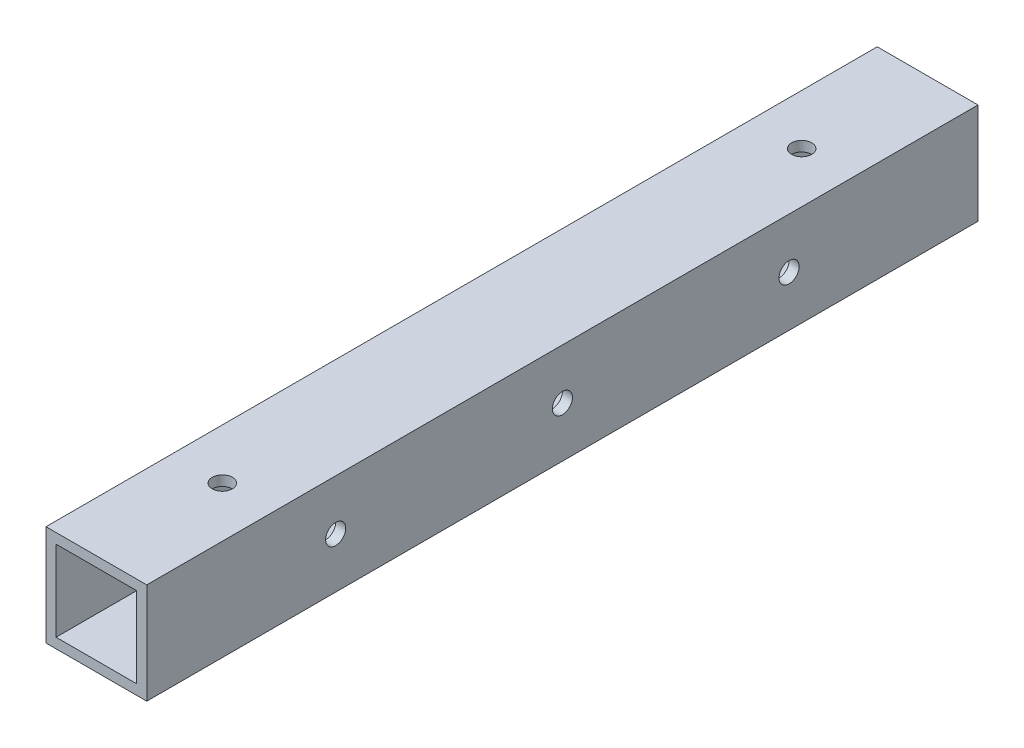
ISO-10303-21;
HEADER;
FILE_DESCRIPTION(('STEP AP214'),'2;1');
FILE_NAME('part.step','',(''),(''),'','','');
FILE_SCHEMA(('AUTOMOTIVE_DESIGN { 1 0 10303 214 1 1 1 1 }'));
ENDSEC;
DATA;
#1=APPLICATION_CONTEXT('core data for automotive mechanical design processes');
#2=APPLICATION_PROTOCOL_DEFINITION('international standard','automotive_design',2000,#1);
#3=PRODUCT_CONTEXT('',#1,'mechanical');
#4=PRODUCT('Part','Part','',(#3));
#5=PRODUCT_RELATED_PRODUCT_CATEGORY('part','',(#4));
#6=PRODUCT_DEFINITION_FORMATION('','',#4);
#7=PRODUCT_DEFINITION_CONTEXT('part definition',#1,'design');
#8=PRODUCT_DEFINITION('design','',#6,#7);
#9=PRODUCT_DEFINITION_SHAPE('','',#8);
#10=(LENGTH_UNIT() NAMED_UNIT(*) SI_UNIT(.MILLI.,.METRE.));
#11=(NAMED_UNIT(*) PLANE_ANGLE_UNIT() SI_UNIT($,.RADIAN.));
#12=(NAMED_UNIT(*) SI_UNIT($,.STERADIAN.) SOLID_ANGLE_UNIT());
#13=UNCERTAINTY_MEASURE_WITH_UNIT(LENGTH_MEASURE(1.E-05),#10,'distance_accuracy_value','');
#14=(GEOMETRIC_REPRESENTATION_CONTEXT(3) GLOBAL_UNCERTAINTY_ASSIGNED_CONTEXT((#13)) GLOBAL_UNIT_ASSIGNED_CONTEXT((#10,
#11,#12)) REPRESENTATION_CONTEXT('',''));
#15=CARTESIAN_POINT('',(0.,0.,0.));
#16=DIRECTION('',(0.,0.,1.));
#17=DIRECTION('',(1.,0.,0.));
#18=AXIS2_PLACEMENT_3D('',#15,#16,#17);
#19=CARTESIAN_POINT('',(0.,0.,165.));
#20=DIRECTION('',(0.,0.,1.));
#21=DIRECTION('',(1.,0.,0.));
#22=AXIS2_PLACEMENT_3D('',#19,#20,#21);
#23=PLANE('',#22);
#24=DIRECTION('',(0.,1.,0.));
#25=VECTOR('',#24,1.);
#26=CARTESIAN_POINT('',(10.,10.,165.));
#27=LINE('',#26,#25);
#28=CARTESIAN_POINT('',(10.,-10.,165.));
#29=VERTEX_POINT('',#28);
#30=CARTESIAN_POINT('',(10.,10.,165.));
#31=VERTEX_POINT('',#30);
#32=EDGE_CURVE('E140',#29,#31,#27,.T.);
#33=ORIENTED_EDGE('',*,*,#32,.T.);
#34=DIRECTION('',(-1.,0.,0.));
#35=VECTOR('',#34,1.);
#36=CARTESIAN_POINT('',(-10.,10.,165.));
#37=LINE('',#36,#35);
#38=CARTESIAN_POINT('',(-10.,10.,165.));
#39=VERTEX_POINT('',#38);
#40=EDGE_CURVE('E143',#31,#39,#37,.T.);
#41=ORIENTED_EDGE('',*,*,#40,.T.);
#42=DIRECTION('',(0.,-1.,0.));
#43=VECTOR('',#42,1.);
#44=CARTESIAN_POINT('',(-10.,10.,165.));
#45=LINE('',#44,#43);
#46=CARTESIAN_POINT('',(-9.99999999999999,-10.,165.));
#47=VERTEX_POINT('',#46);
#48=EDGE_CURVE('E146',#39,#47,#45,.T.);
#49=ORIENTED_EDGE('',*,*,#48,.T.);
#50=DIRECTION('',(1.,0.,0.));
#51=VECTOR('',#50,1.);
#52=CARTESIAN_POINT('',(-9.99999999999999,-10.,165.));
#53=LINE('',#52,#51);
#54=EDGE_CURVE('E148',#47,#29,#53,.T.);
#55=ORIENTED_EDGE('',*,*,#54,.T.);
#56=EDGE_LOOP('',(#33,#41,#49,#55));
#57=FACE_BOUND('',#56,.T.);
#58=DIRECTION('',(1.,0.,0.));
#59=VECTOR('',#58,1.);
#60=CARTESIAN_POINT('',(-8.,-8.,165.));
#61=LINE('',#60,#59);
#62=CARTESIAN_POINT('',(-8.,-8.,165.));
#63=VERTEX_POINT('',#62);
#64=CARTESIAN_POINT('',(8.,-8.,165.));
#65=VERTEX_POINT('',#64);
#66=EDGE_CURVE('E110',#63,#65,#61,.T.);
#67=ORIENTED_EDGE('',*,*,#66,.F.);
#68=DIRECTION('',(0.,-1.,0.));
#69=VECTOR('',#68,1.);
#70=CARTESIAN_POINT('',(-8.,8.,165.));
#71=LINE('',#70,#69);
#72=CARTESIAN_POINT('',(-8.,8.,165.));
#73=VERTEX_POINT('',#72);
#74=EDGE_CURVE('E102',#73,#63,#71,.T.);
#75=ORIENTED_EDGE('',*,*,#74,.F.);
#76=DIRECTION('',(-1.,0.,0.));
#77=VECTOR('',#76,1.);
#78=CARTESIAN_POINT('',(-8.,8.,165.));
#79=LINE('',#78,#77);
#80=CARTESIAN_POINT('',(8.,8.,165.));
#81=VERTEX_POINT('',#80);
#82=EDGE_CURVE('E124',#81,#73,#79,.T.);
#83=ORIENTED_EDGE('',*,*,#82,.F.);
#84=DIRECTION('',(0.,1.,0.));
#85=VECTOR('',#84,1.);
#86=CARTESIAN_POINT('',(8.,8.,165.));
#87=LINE('',#86,#85);
#88=EDGE_CURVE('E122',#65,#81,#87,.T.);
#89=ORIENTED_EDGE('',*,*,#88,.F.);
#90=EDGE_LOOP('',(#67,#75,#83,#89));
#91=FACE_BOUND('',#90,.T.);
#92=ADVANCED_FACE('F35',(#57,#91),#23,.T.);
#93=CARTESIAN_POINT('',(0.,0.,0.));
#94=DIRECTION('',(0.,0.,1.));
#95=DIRECTION('',(1.,0.,0.));
#96=AXIS2_PLACEMENT_3D('',#93,#94,#95);
#97=PLANE('',#96);
#98=DIRECTION('',(0.,1.,0.));
#99=VECTOR('',#98,1.);
#100=CARTESIAN_POINT('',(10.,10.,0.));
#101=LINE('',#100,#99);
#102=CARTESIAN_POINT('',(10.,-10.,0.));
#103=VERTEX_POINT('',#102);
#104=CARTESIAN_POINT('',(10.,10.,0.));
#105=VERTEX_POINT('',#104);
#106=EDGE_CURVE('E118',#103,#105,#101,.T.);
#107=ORIENTED_EDGE('',*,*,#106,.F.);
#108=DIRECTION('',(1.,0.,0.));
#109=VECTOR('',#108,1.);
#110=CARTESIAN_POINT('',(-9.99999999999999,-10.,0.));
#111=LINE('',#110,#109);
#112=CARTESIAN_POINT('',(-9.99999999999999,-10.,0.));
#113=VERTEX_POINT('',#112);
#114=EDGE_CURVE('E144',#113,#103,#111,.T.);
#115=ORIENTED_EDGE('',*,*,#114,.F.);
#116=DIRECTION('',(0.,-1.,0.));
#117=VECTOR('',#116,1.);
#118=CARTESIAN_POINT('',(-10.,10.,0.));
#119=LINE('',#118,#117);
#120=CARTESIAN_POINT('',(-10.,10.,0.));
#121=VERTEX_POINT('',#120);
#122=EDGE_CURVE('E155',#121,#113,#119,.T.);
#123=ORIENTED_EDGE('',*,*,#122,.F.);
#124=DIRECTION('',(-1.,0.,0.));
#125=VECTOR('',#124,1.);
#126=CARTESIAN_POINT('',(-10.,10.,0.));
#127=LINE('',#126,#125);
#128=EDGE_CURVE('E153',#105,#121,#127,.T.);
#129=ORIENTED_EDGE('',*,*,#128,.F.);
#130=EDGE_LOOP('',(#107,#115,#123,#129));
#131=FACE_BOUND('',#130,.T.);
#132=DIRECTION('',(0.,-1.,0.));
#133=VECTOR('',#132,1.);
#134=CARTESIAN_POINT('',(-8.,8.,0.));
#135=LINE('',#134,#133);
#136=CARTESIAN_POINT('',(-8.,8.,0.));
#137=VERTEX_POINT('',#136);
#138=CARTESIAN_POINT('',(-8.,-8.,0.));
#139=VERTEX_POINT('',#138);
#140=EDGE_CURVE('E60',#137,#139,#135,.T.);
#141=ORIENTED_EDGE('',*,*,#140,.T.);
#142=DIRECTION('',(1.,0.,0.));
#143=VECTOR('',#142,1.);
#144=CARTESIAN_POINT('',(-8.,-8.,0.));
#145=LINE('',#144,#143);
#146=CARTESIAN_POINT('',(8.,-8.,0.));
#147=VERTEX_POINT('',#146);
#148=EDGE_CURVE('E117',#139,#147,#145,.T.);
#149=ORIENTED_EDGE('',*,*,#148,.T.);
#150=DIRECTION('',(0.,1.,0.));
#151=VECTOR('',#150,1.);
#152=CARTESIAN_POINT('',(8.,8.,0.));
#153=LINE('',#152,#151);
#154=CARTESIAN_POINT('',(8.,8.,0.));
#155=VERTEX_POINT('',#154);
#156=EDGE_CURVE('E132',#147,#155,#153,.T.);
#157=ORIENTED_EDGE('',*,*,#156,.T.);
#158=DIRECTION('',(-1.,0.,0.));
#159=VECTOR('',#158,1.);
#160=CARTESIAN_POINT('',(-8.,8.,0.));
#161=LINE('',#160,#159);
#162=EDGE_CURVE('E111',#155,#137,#161,.T.);
#163=ORIENTED_EDGE('',*,*,#162,.T.);
#164=EDGE_LOOP('',(#141,#149,#157,#163));
#165=FACE_BOUND('',#164,.T.);
#166=ADVANCED_FACE('F238',(#131,#165),#97,.F.);
#167=CARTESIAN_POINT('',(10.,10.,165.));
#168=DIRECTION('',(-1.,0.,0.));
#169=DIRECTION('',(0.,-1.,0.));
#170=AXIS2_PLACEMENT_3D('',#167,#168,#169);
#171=PLANE('',#170);
#172=CARTESIAN_POINT('',(10.,0.,37.5000000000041));
#173=DIRECTION('',(-1.,0.,0.));
#174=DIRECTION('',(0.,0.,1.));
#175=AXIS2_PLACEMENT_3D('',#172,#173,#174);
#176=CIRCLE('',#175,2.);
#177=CARTESIAN_POINT('',(10.,0.,39.5000000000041));
#178=VERTEX_POINT('',#177);
#179=EDGE_CURVE('E323',#178,#178,#176,.T.);
#180=ORIENTED_EDGE('',*,*,#179,.T.);
#181=EDGE_LOOP('',(#180));
#182=FACE_BOUND('',#181,.T.);
#183=CARTESIAN_POINT('',(10.,0.,82.5000000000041));
#184=DIRECTION('',(-1.,0.,0.));
#185=DIRECTION('',(0.,0.,1.));
#186=AXIS2_PLACEMENT_3D('',#183,#184,#185);
#187=CIRCLE('',#186,2.);
#188=CARTESIAN_POINT('',(10.,0.,84.5000000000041));
#189=VERTEX_POINT('',#188);
#190=EDGE_CURVE('E176',#189,#189,#187,.T.);
#191=ORIENTED_EDGE('',*,*,#190,.T.);
#192=EDGE_LOOP('',(#191));
#193=FACE_BOUND('',#192,.T.);
#194=CARTESIAN_POINT('',(10.,0.,127.500000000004));
#195=DIRECTION('',(-1.,0.,0.));
#196=DIRECTION('',(0.,0.,1.));
#197=AXIS2_PLACEMENT_3D('',#194,#195,#196);
#198=CIRCLE('',#197,2.);
#199=CARTESIAN_POINT('',(10.,0.,129.500000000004));
#200=VERTEX_POINT('',#199);
#201=EDGE_CURVE('E172',#200,#200,#198,.T.);
#202=ORIENTED_EDGE('',*,*,#201,.T.);
#203=EDGE_LOOP('',(#202));
#204=FACE_BOUND('',#203,.T.);
#205=ORIENTED_EDGE('',*,*,#106,.T.);
#206=DIRECTION('',(0.,0.,-1.));
#207=VECTOR('',#206,1.);
#208=CARTESIAN_POINT('',(10.,10.,165.));
#209=LINE('',#208,#207);
#210=EDGE_CURVE('E11',#31,#105,#209,.T.);
#211=ORIENTED_EDGE('',*,*,#210,.F.);
#212=ORIENTED_EDGE('',*,*,#32,.F.);
#213=DIRECTION('',(0.,0.,-1.));
#214=VECTOR('',#213,1.);
#215=CARTESIAN_POINT('',(10.,-10.,165.));
#216=LINE('',#215,#214);
#217=EDGE_CURVE('E150',#29,#103,#216,.T.);
#218=ORIENTED_EDGE('',*,*,#217,.T.);
#219=EDGE_LOOP('',(#205,#211,#212,#218));
#220=FACE_BOUND('',#219,.T.);
#221=ADVANCED_FACE('F37',(#182,#193,#204,#220),#171,.F.);
#222=CARTESIAN_POINT('',(-10.,10.,165.));
#223=DIRECTION('',(0.,-1.,0.));
#224=DIRECTION('',(0.,0.,-1.));
#225=AXIS2_PLACEMENT_3D('',#222,#223,#224);
#226=PLANE('',#225);
#227=CARTESIAN_POINT('',(0.,10.,140.));
#228=DIRECTION('',(0.,1.,0.));
#229=DIRECTION('',(0.,0.,1.));
#230=AXIS2_PLACEMENT_3D('',#227,#228,#229);
#231=CIRCLE('',#230,1.99999999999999);
#232=CARTESIAN_POINT('',(0.,10.,142.));
#233=VERTEX_POINT('',#232);
#234=EDGE_CURVE('E198',#233,#233,#231,.T.);
#235=ORIENTED_EDGE('',*,*,#234,.F.);
#236=EDGE_LOOP('',(#235));
#237=FACE_BOUND('',#236,.T.);
#238=CARTESIAN_POINT('',(0.,10.,25.));
#239=DIRECTION('',(0.,1.,0.));
#240=DIRECTION('',(0.,0.,1.));
#241=AXIS2_PLACEMENT_3D('',#238,#239,#240);
#242=CIRCLE('',#241,1.99999999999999);
#243=CARTESIAN_POINT('',(0.,10.,27.));
#244=VERTEX_POINT('',#243);
#245=EDGE_CURVE('E210',#244,#244,#242,.T.);
#246=ORIENTED_EDGE('',*,*,#245,.F.);
#247=EDGE_LOOP('',(#246));
#248=FACE_BOUND('',#247,.T.);
#249=ORIENTED_EDGE('',*,*,#128,.T.);
#250=DIRECTION('',(0.,0.,-1.));
#251=VECTOR('',#250,1.);
#252=CARTESIAN_POINT('',(-10.,10.,165.));
#253=LINE('',#252,#251);
#254=EDGE_CURVE('E44',#39,#121,#253,.T.);
#255=ORIENTED_EDGE('',*,*,#254,.F.);
#256=ORIENTED_EDGE('',*,*,#40,.F.);
#257=ORIENTED_EDGE('',*,*,#210,.T.);
#258=EDGE_LOOP('',(#249,#255,#256,#257));
#259=FACE_BOUND('',#258,.T.);
#260=ADVANCED_FACE('F252',(#237,#248,#259),#226,.F.);
#261=CARTESIAN_POINT('',(-10.,10.,165.));
#262=DIRECTION('',(1.,0.,0.));
#263=DIRECTION('',(0.,1.,0.));
#264=AXIS2_PLACEMENT_3D('',#261,#262,#263);
#265=PLANE('',#264);
#266=CARTESIAN_POINT('',(-10.,0.,37.5000000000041));
#267=DIRECTION('',(-1.,0.,0.));
#268=DIRECTION('',(0.,0.,1.));
#269=AXIS2_PLACEMENT_3D('',#266,#267,#268);
#270=CIRCLE('',#269,1.99999999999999);
#271=CARTESIAN_POINT('',(-10.,0.,39.500000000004));
#272=VERTEX_POINT('',#271);
#273=EDGE_CURVE('E322',#272,#272,#270,.T.);
#274=ORIENTED_EDGE('',*,*,#273,.F.);
#275=EDGE_LOOP('',(#274));
#276=FACE_BOUND('',#275,.T.);
#277=CARTESIAN_POINT('',(-10.,0.,82.5000000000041));
#278=DIRECTION('',(-1.,0.,0.));
#279=DIRECTION('',(0.,0.,1.));
#280=AXIS2_PLACEMENT_3D('',#277,#278,#279);
#281=CIRCLE('',#280,1.99999999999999);
#282=CARTESIAN_POINT('',(-10.,0.,84.5000000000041));
#283=VERTEX_POINT('',#282);
#284=EDGE_CURVE('E183',#283,#283,#281,.T.);
#285=ORIENTED_EDGE('',*,*,#284,.F.);
#286=EDGE_LOOP('',(#285));
#287=FACE_BOUND('',#286,.T.);
#288=CARTESIAN_POINT('',(-10.,0.,127.500000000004));
#289=DIRECTION('',(-1.,0.,0.));
#290=DIRECTION('',(0.,0.,1.));
#291=AXIS2_PLACEMENT_3D('',#288,#289,#290);
#292=CIRCLE('',#291,1.99999999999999);
#293=CARTESIAN_POINT('',(-10.,0.,129.500000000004));
#294=VERTEX_POINT('',#293);
#295=EDGE_CURVE('E180',#294,#294,#292,.T.);
#296=ORIENTED_EDGE('',*,*,#295,.F.);
#297=EDGE_LOOP('',(#296));
#298=FACE_BOUND('',#297,.T.);
#299=ORIENTED_EDGE('',*,*,#122,.T.);
#300=DIRECTION('',(0.,0.,-1.));
#301=VECTOR('',#300,1.);
#302=CARTESIAN_POINT('',(-9.99999999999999,-10.,165.));
#303=LINE('',#302,#301);
#304=EDGE_CURVE('E160',#47,#113,#303,.T.);
#305=ORIENTED_EDGE('',*,*,#304,.F.);
#306=ORIENTED_EDGE('',*,*,#48,.F.);
#307=ORIENTED_EDGE('',*,*,#254,.T.);
#308=EDGE_LOOP('',(#299,#305,#306,#307));
#309=FACE_BOUND('',#308,.T.);
#310=ADVANCED_FACE('F249',(#276,#287,#298,#309),#265,.F.);
#311=CARTESIAN_POINT('',(-9.99999999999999,-10.,165.));
#312=DIRECTION('',(0.,1.,0.));
#313=DIRECTION('',(0.,0.,1.));
#314=AXIS2_PLACEMENT_3D('',#311,#312,#313);
#315=PLANE('',#314);
#316=CARTESIAN_POINT('',(0.,-10.,140.));
#317=DIRECTION('',(0.,1.,0.));
#318=DIRECTION('',(0.,0.,1.));
#319=AXIS2_PLACEMENT_3D('',#316,#317,#318);
#320=CIRCLE('',#319,2.);
#321=CARTESIAN_POINT('',(0.,-10.,142.));
#322=VERTEX_POINT('',#321);
#323=EDGE_CURVE('E201',#322,#322,#320,.T.);
#324=ORIENTED_EDGE('',*,*,#323,.T.);
#325=EDGE_LOOP('',(#324));
#326=FACE_BOUND('',#325,.T.);
#327=CARTESIAN_POINT('',(0.,-10.,25.));
#328=DIRECTION('',(0.,1.,0.));
#329=DIRECTION('',(0.,0.,1.));
#330=AXIS2_PLACEMENT_3D('',#327,#328,#329);
#331=CIRCLE('',#330,2.);
#332=CARTESIAN_POINT('',(0.,-10.,27.));
#333=VERTEX_POINT('',#332);
#334=EDGE_CURVE('E168',#333,#333,#331,.T.);
#335=ORIENTED_EDGE('',*,*,#334,.T.);
#336=EDGE_LOOP('',(#335));
#337=FACE_BOUND('',#336,.T.);
#338=ORIENTED_EDGE('',*,*,#114,.T.);
#339=ORIENTED_EDGE('',*,*,#217,.F.);
#340=ORIENTED_EDGE('',*,*,#54,.F.);
#341=ORIENTED_EDGE('',*,*,#304,.T.);
#342=EDGE_LOOP('',(#338,#339,#340,#341));
#343=FACE_BOUND('',#342,.T.);
#344=ADVANCED_FACE('F233',(#326,#337,#343),#315,.F.);
#345=CARTESIAN_POINT('',(-8.,8.,165.));
#346=DIRECTION('',(1.,0.,0.));
#347=DIRECTION('',(0.,0.,-1.));
#348=AXIS2_PLACEMENT_3D('',#345,#346,#347);
#349=PLANE('',#348);
#350=CARTESIAN_POINT('',(-8.,0.,37.5000000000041));
#351=DIRECTION('',(1.,0.,0.));
#352=DIRECTION('',(0.,0.,-1.));
#353=AXIS2_PLACEMENT_3D('',#350,#351,#352);
#354=CIRCLE('',#353,1.99999999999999);
#355=CARTESIAN_POINT('',(-8.,0.,35.5000000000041));
#356=VERTEX_POINT('',#355);
#357=EDGE_CURVE('E39',#356,#356,#354,.T.);
#358=ORIENTED_EDGE('',*,*,#357,.F.);
#359=EDGE_LOOP('',(#358));
#360=FACE_BOUND('',#359,.T.);
#361=CARTESIAN_POINT('',(-8.,0.,82.5000000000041));
#362=DIRECTION('',(1.,0.,0.));
#363=DIRECTION('',(0.,0.,-1.));
#364=AXIS2_PLACEMENT_3D('',#361,#362,#363);
#365=CIRCLE('',#364,1.99999999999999);
#366=CARTESIAN_POINT('',(-8.,0.,80.5000000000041));
#367=VERTEX_POINT('',#366);
#368=EDGE_CURVE('E175',#367,#367,#365,.T.);
#369=ORIENTED_EDGE('',*,*,#368,.F.);
#370=EDGE_LOOP('',(#369));
#371=FACE_BOUND('',#370,.T.);
#372=CARTESIAN_POINT('',(-8.,0.,127.500000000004));
#373=DIRECTION('',(1.,0.,0.));
#374=DIRECTION('',(0.,0.,-1.));
#375=AXIS2_PLACEMENT_3D('',#372,#373,#374);
#376=CIRCLE('',#375,1.99999999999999);
#377=CARTESIAN_POINT('',(-8.,0.,125.500000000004));
#378=VERTEX_POINT('',#377);
#379=EDGE_CURVE('E171',#378,#378,#376,.T.);
#380=ORIENTED_EDGE('',*,*,#379,.F.);
#381=EDGE_LOOP('',(#380));
#382=FACE_BOUND('',#381,.T.);
#383=ORIENTED_EDGE('',*,*,#140,.F.);
#384=DIRECTION('',(0.,0.,-1.));
#385=VECTOR('',#384,1.);
#386=CARTESIAN_POINT('',(-8.,8.,165.));
#387=LINE('',#386,#385);
#388=EDGE_CURVE('E106',#73,#137,#387,.T.);
#389=ORIENTED_EDGE('',*,*,#388,.F.);
#390=ORIENTED_EDGE('',*,*,#74,.T.);
#391=DIRECTION('',(0.,0.,-1.));
#392=VECTOR('',#391,1.);
#393=CARTESIAN_POINT('',(-8.,-8.,165.));
#394=LINE('',#393,#392);
#395=EDGE_CURVE('E105',#63,#139,#394,.T.);
#396=ORIENTED_EDGE('',*,*,#395,.T.);
#397=EDGE_LOOP('',(#383,#389,#390,#396));
#398=FACE_BOUND('',#397,.T.);
#399=ADVANCED_FACE('F104',(#360,#371,#382,#398),#349,.T.);
#400=CARTESIAN_POINT('',(-8.,-8.,165.));
#401=DIRECTION('',(0.,1.,0.));
#402=DIRECTION('',(-1.,0.,0.));
#403=AXIS2_PLACEMENT_3D('',#400,#401,#402);
#404=PLANE('',#403);
#405=CARTESIAN_POINT('',(0.,-8.,140.));
#406=DIRECTION('',(0.,1.,0.));
#407=DIRECTION('',(-1.,0.,0.));
#408=AXIS2_PLACEMENT_3D('',#405,#406,#407);
#409=CIRCLE('',#408,1.99999999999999);
#410=CARTESIAN_POINT('',(-1.99999999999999,-8.,140.));
#411=VERTEX_POINT('',#410);
#412=EDGE_CURVE('E207',#411,#411,#409,.T.);
#413=ORIENTED_EDGE('',*,*,#412,.F.);
#414=EDGE_LOOP('',(#413));
#415=FACE_BOUND('',#414,.T.);
#416=CARTESIAN_POINT('',(0.,-8.,25.));
#417=DIRECTION('',(0.,1.,0.));
#418=DIRECTION('',(-1.,0.,0.));
#419=AXIS2_PLACEMENT_3D('',#416,#417,#418);
#420=CIRCLE('',#419,1.99999999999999);
#421=CARTESIAN_POINT('',(-1.99999999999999,-8.,25.));
#422=VERTEX_POINT('',#421);
#423=EDGE_CURVE('E130',#422,#422,#420,.T.);
#424=ORIENTED_EDGE('',*,*,#423,.F.);
#425=EDGE_LOOP('',(#424));
#426=FACE_BOUND('',#425,.T.);
#427=ORIENTED_EDGE('',*,*,#148,.F.);
#428=ORIENTED_EDGE('',*,*,#395,.F.);
#429=ORIENTED_EDGE('',*,*,#66,.T.);
#430=DIRECTION('',(0.,0.,-1.));
#431=VECTOR('',#430,1.);
#432=CARTESIAN_POINT('',(8.,-8.,165.));
#433=LINE('',#432,#431);
#434=EDGE_CURVE('E119',#65,#147,#433,.T.);
#435=ORIENTED_EDGE('',*,*,#434,.T.);
#436=EDGE_LOOP('',(#427,#428,#429,#435));
#437=FACE_BOUND('',#436,.T.);
#438=ADVANCED_FACE('F114',(#415,#426,#437),#404,.T.);
#439=CARTESIAN_POINT('',(8.,8.,165.));
#440=DIRECTION('',(-1.,0.,0.));
#441=DIRECTION('',(0.,0.,1.));
#442=AXIS2_PLACEMENT_3D('',#439,#440,#441);
#443=PLANE('',#442);
#444=CARTESIAN_POINT('',(8.,0.,37.5000000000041));
#445=DIRECTION('',(-1.,0.,0.));
#446=DIRECTION('',(0.,0.,1.));
#447=AXIS2_PLACEMENT_3D('',#444,#445,#446);
#448=CIRCLE('',#447,1.99999999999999);
#449=CARTESIAN_POINT('',(8.,0.,39.5000000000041));
#450=VERTEX_POINT('',#449);
#451=EDGE_CURVE('E188',#450,#450,#448,.T.);
#452=ORIENTED_EDGE('',*,*,#451,.F.);
#453=EDGE_LOOP('',(#452));
#454=FACE_BOUND('',#453,.T.);
#455=CARTESIAN_POINT('',(8.,0.,82.5000000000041));
#456=DIRECTION('',(-1.,0.,0.));
#457=DIRECTION('',(0.,0.,1.));
#458=AXIS2_PLACEMENT_3D('',#455,#456,#457);
#459=CIRCLE('',#458,1.99999999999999);
#460=CARTESIAN_POINT('',(8.,0.,84.5000000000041));
#461=VERTEX_POINT('',#460);
#462=EDGE_CURVE('E173',#461,#461,#459,.T.);
#463=ORIENTED_EDGE('',*,*,#462,.F.);
#464=EDGE_LOOP('',(#463));
#465=FACE_BOUND('',#464,.T.);
#466=CARTESIAN_POINT('',(8.,0.,127.500000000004));
#467=DIRECTION('',(-1.,0.,0.));
#468=DIRECTION('',(0.,0.,1.));
#469=AXIS2_PLACEMENT_3D('',#466,#467,#468);
#470=CIRCLE('',#469,1.99999999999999);
#471=CARTESIAN_POINT('',(8.,0.,129.500000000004));
#472=VERTEX_POINT('',#471);
#473=EDGE_CURVE('E169',#472,#472,#470,.T.);
#474=ORIENTED_EDGE('',*,*,#473,.F.);
#475=EDGE_LOOP('',(#474));
#476=FACE_BOUND('',#475,.T.);
#477=ORIENTED_EDGE('',*,*,#156,.F.);
#478=ORIENTED_EDGE('',*,*,#434,.F.);
#479=ORIENTED_EDGE('',*,*,#88,.T.);
#480=DIRECTION('',(0.,0.,-1.));
#481=VECTOR('',#480,1.);
#482=CARTESIAN_POINT('',(8.,8.,165.));
#483=LINE('',#482,#481);
#484=EDGE_CURVE('E52',#81,#155,#483,.T.);
#485=ORIENTED_EDGE('',*,*,#484,.T.);
#486=EDGE_LOOP('',(#477,#478,#479,#485));
#487=FACE_BOUND('',#486,.T.);
#488=ADVANCED_FACE('F221',(#454,#465,#476,#487),#443,.T.);
#489=CARTESIAN_POINT('',(-8.,8.,165.));
#490=DIRECTION('',(0.,-1.,0.));
#491=DIRECTION('',(0.,0.,-1.));
#492=AXIS2_PLACEMENT_3D('',#489,#490,#491);
#493=PLANE('',#492);
#494=CARTESIAN_POINT('',(0.,8.,140.));
#495=DIRECTION('',(0.,-1.,0.));
#496=DIRECTION('',(0.,0.,-1.));
#497=AXIS2_PLACEMENT_3D('',#494,#495,#496);
#498=CIRCLE('',#497,1.99999999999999);
#499=CARTESIAN_POINT('',(0.,8.,138.));
#500=VERTEX_POINT('',#499);
#501=EDGE_CURVE('E204',#500,#500,#498,.T.);
#502=ORIENTED_EDGE('',*,*,#501,.F.);
#503=EDGE_LOOP('',(#502));
#504=FACE_BOUND('',#503,.T.);
#505=CARTESIAN_POINT('',(0.,8.,25.));
#506=DIRECTION('',(0.,-1.,0.));
#507=DIRECTION('',(0.,0.,-1.));
#508=AXIS2_PLACEMENT_3D('',#505,#506,#507);
#509=CIRCLE('',#508,1.99999999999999);
#510=CARTESIAN_POINT('',(0.,8.,23.));
#511=VERTEX_POINT('',#510);
#512=EDGE_CURVE('E165',#511,#511,#509,.T.);
#513=ORIENTED_EDGE('',*,*,#512,.F.);
#514=EDGE_LOOP('',(#513));
#515=FACE_BOUND('',#514,.T.);
#516=ORIENTED_EDGE('',*,*,#162,.F.);
#517=ORIENTED_EDGE('',*,*,#484,.F.);
#518=ORIENTED_EDGE('',*,*,#82,.T.);
#519=ORIENTED_EDGE('',*,*,#388,.T.);
#520=EDGE_LOOP('',(#516,#517,#518,#519));
#521=FACE_BOUND('',#520,.T.);
#522=ADVANCED_FACE('F229',(#504,#515,#521),#493,.T.);
#523=CARTESIAN_POINT('',(0.,10.,25.));
#524=DIRECTION('',(0.,1.,0.));
#525=DIRECTION('',(0.,0.,1.));
#526=AXIS2_PLACEMENT_3D('',#523,#524,#525);
#527=CYLINDRICAL_SURFACE('',#526,1.99999999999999);
#528=ORIENTED_EDGE('',*,*,#512,.T.);
#529=EDGE_LOOP('',(#528));
#530=FACE_BOUND('',#529,.T.);
#531=ORIENTED_EDGE('',*,*,#245,.T.);
#532=EDGE_LOOP('',(#531));
#533=FACE_BOUND('',#532,.T.);
#534=ADVANCED_FACE('F282',(#530,#533),#527,.F.);
#535=ORIENTED_EDGE('',*,*,#423,.T.);
#536=EDGE_LOOP('',(#535));
#537=FACE_BOUND('',#536,.T.);
#538=ORIENTED_EDGE('',*,*,#334,.F.);
#539=EDGE_LOOP('',(#538));
#540=FACE_BOUND('',#539,.T.);
#541=ADVANCED_FACE('F217',(#537,#540),#527,.F.);
#542=CARTESIAN_POINT('',(0.,10.,140.));
#543=DIRECTION('',(0.,1.,0.));
#544=DIRECTION('',(0.,0.,1.));
#545=AXIS2_PLACEMENT_3D('',#542,#543,#544);
#546=CYLINDRICAL_SURFACE('',#545,1.99999999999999);
#547=ORIENTED_EDGE('',*,*,#412,.T.);
#548=EDGE_LOOP('',(#547));
#549=FACE_BOUND('',#548,.T.);
#550=ORIENTED_EDGE('',*,*,#323,.F.);
#551=EDGE_LOOP('',(#550));
#552=FACE_BOUND('',#551,.T.);
#553=ADVANCED_FACE('F297',(#549,#552),#546,.F.);
#554=ORIENTED_EDGE('',*,*,#501,.T.);
#555=EDGE_LOOP('',(#554));
#556=FACE_BOUND('',#555,.T.);
#557=ORIENTED_EDGE('',*,*,#234,.T.);
#558=EDGE_LOOP('',(#557));
#559=FACE_BOUND('',#558,.T.);
#560=ADVANCED_FACE('F293',(#556,#559),#546,.F.);
#561=CARTESIAN_POINT('',(-9.99999999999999,0.,127.500000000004));
#562=DIRECTION('',(-1.,0.,0.));
#563=DIRECTION('',(0.,0.,1.));
#564=AXIS2_PLACEMENT_3D('',#561,#562,#563);
#565=CYLINDRICAL_SURFACE('',#564,1.99999999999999);
#566=ORIENTED_EDGE('',*,*,#473,.T.);
#567=EDGE_LOOP('',(#566));
#568=FACE_BOUND('',#567,.T.);
#569=ORIENTED_EDGE('',*,*,#201,.F.);
#570=EDGE_LOOP('',(#569));
#571=FACE_BOUND('',#570,.T.);
#572=ADVANCED_FACE('F296',(#568,#571),#565,.F.);
#573=ORIENTED_EDGE('',*,*,#379,.T.);
#574=EDGE_LOOP('',(#573));
#575=FACE_BOUND('',#574,.T.);
#576=ORIENTED_EDGE('',*,*,#295,.T.);
#577=EDGE_LOOP('',(#576));
#578=FACE_BOUND('',#577,.T.);
#579=ADVANCED_FACE('F301',(#575,#578),#565,.F.);
#580=CARTESIAN_POINT('',(-9.99999999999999,0.,82.5000000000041));
#581=DIRECTION('',(-1.,0.,0.));
#582=DIRECTION('',(0.,0.,1.));
#583=AXIS2_PLACEMENT_3D('',#580,#581,#582);
#584=CYLINDRICAL_SURFACE('',#583,1.99999999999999);
#585=ORIENTED_EDGE('',*,*,#462,.T.);
#586=EDGE_LOOP('',(#585));
#587=FACE_BOUND('',#586,.T.);
#588=ORIENTED_EDGE('',*,*,#190,.F.);
#589=EDGE_LOOP('',(#588));
#590=FACE_BOUND('',#589,.T.);
#591=ADVANCED_FACE('F303',(#587,#590),#584,.F.);
#592=ORIENTED_EDGE('',*,*,#368,.T.);
#593=EDGE_LOOP('',(#592));
#594=FACE_BOUND('',#593,.T.);
#595=ORIENTED_EDGE('',*,*,#284,.T.);
#596=EDGE_LOOP('',(#595));
#597=FACE_BOUND('',#596,.T.);
#598=ADVANCED_FACE('F306',(#594,#597),#584,.F.);
#599=CARTESIAN_POINT('',(-9.99999999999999,0.,37.5000000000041));
#600=DIRECTION('',(-1.,0.,0.));
#601=DIRECTION('',(0.,0.,1.));
#602=AXIS2_PLACEMENT_3D('',#599,#600,#601);
#603=CYLINDRICAL_SURFACE('',#602,1.99999999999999);
#604=ORIENTED_EDGE('',*,*,#357,.T.);
#605=EDGE_LOOP('',(#604));
#606=FACE_BOUND('',#605,.T.);
#607=ORIENTED_EDGE('',*,*,#273,.T.);
#608=EDGE_LOOP('',(#607));
#609=FACE_BOUND('',#608,.T.);
#610=ADVANCED_FACE('F307',(#606,#609),#603,.F.);
#611=ORIENTED_EDGE('',*,*,#451,.T.);
#612=EDGE_LOOP('',(#611));
#613=FACE_BOUND('',#612,.T.);
#614=ORIENTED_EDGE('',*,*,#179,.F.);
#615=EDGE_LOOP('',(#614));
#616=FACE_BOUND('',#615,.T.);
#617=ADVANCED_FACE('F309',(#613,#616),#603,.F.);
#618=CLOSED_SHELL('',(#92,#166,#221,#260,#310,#344,#399,#438,#488,#522,#534,#541,#553,#560,#572,
#579,#591,#598,#610,#617));
#619=MANIFOLD_SOLID_BREP('B2',#618);
#620=ADVANCED_BREP_SHAPE_REPRESENTATION('',(#18,#619),#14);
#621=SHAPE_DEFINITION_REPRESENTATION(#9,#620);
ENDSEC;
END-ISO-10303-21;
